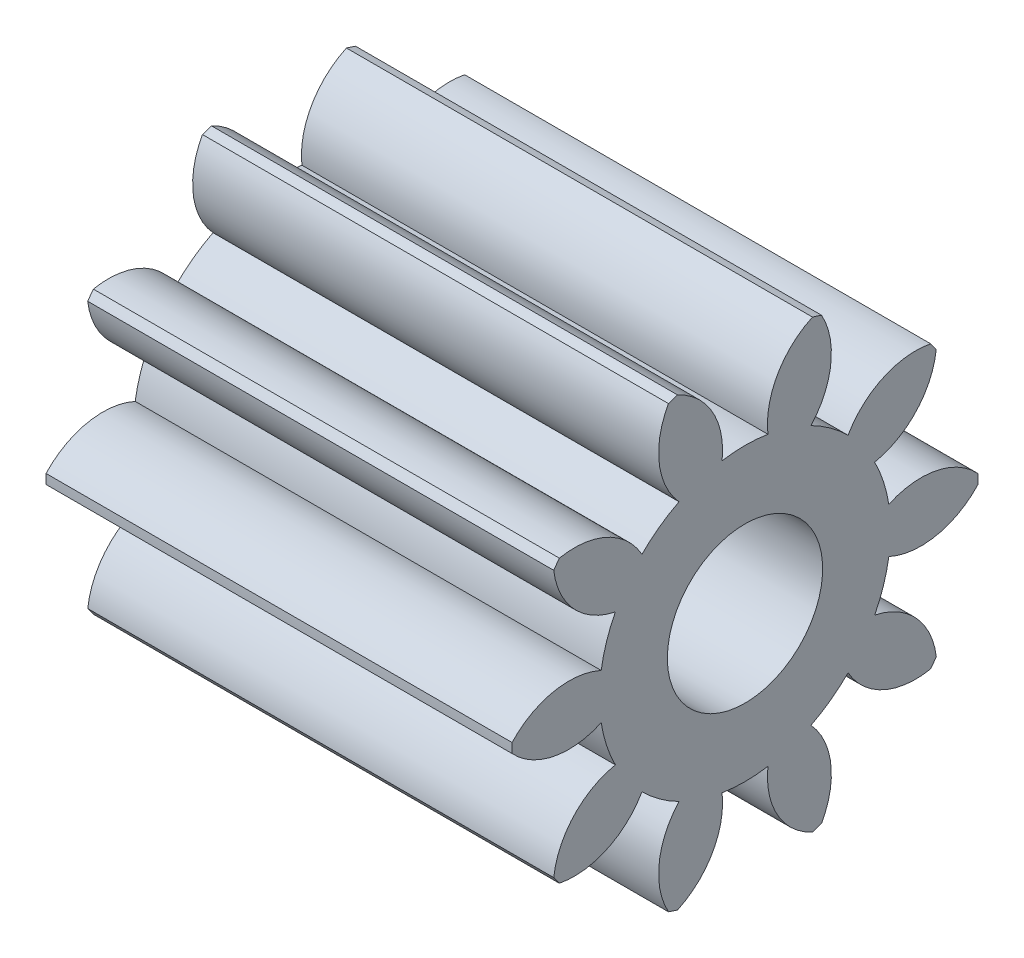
ISO-10303-21;
HEADER;
FILE_DESCRIPTION(('STEP AP214'),'2;1');
FILE_NAME('part.step','',(''),(''),'','','');
FILE_SCHEMA(('AUTOMOTIVE_DESIGN { 1 0 10303 214 1 1 1 1 }'));
ENDSEC;
DATA;
#1=APPLICATION_CONTEXT('core data for automotive mechanical design processes');
#2=APPLICATION_PROTOCOL_DEFINITION('international standard','automotive_design',2000,#1);
#3=PRODUCT_CONTEXT('',#1,'mechanical');
#4=PRODUCT('Part','Part','',(#3));
#5=PRODUCT_RELATED_PRODUCT_CATEGORY('part','',(#4));
#6=PRODUCT_DEFINITION_FORMATION('','',#4);
#7=PRODUCT_DEFINITION_CONTEXT('part definition',#1,'design');
#8=PRODUCT_DEFINITION('design','',#6,#7);
#9=PRODUCT_DEFINITION_SHAPE('','',#8);
#10=(LENGTH_UNIT() NAMED_UNIT(*) SI_UNIT(.MILLI.,.METRE.));
#11=(NAMED_UNIT(*) PLANE_ANGLE_UNIT() SI_UNIT($,.RADIAN.));
#12=(NAMED_UNIT(*) SI_UNIT($,.STERADIAN.) SOLID_ANGLE_UNIT());
#13=UNCERTAINTY_MEASURE_WITH_UNIT(LENGTH_MEASURE(1.E-05),#10,'distance_accuracy_value','');
#14=(GEOMETRIC_REPRESENTATION_CONTEXT(3) GLOBAL_UNCERTAINTY_ASSIGNED_CONTEXT((#13)) GLOBAL_UNIT_ASSIGNED_CONTEXT((#10,
#11,#12)) REPRESENTATION_CONTEXT('',''));
#15=CARTESIAN_POINT('',(0.,0.,0.));
#16=DIRECTION('',(0.,0.,1.));
#17=DIRECTION('',(1.,0.,0.));
#18=AXIS2_PLACEMENT_3D('',#15,#16,#17);
#19=CARTESIAN_POINT('',(15.,0.,0.));
#20=DIRECTION('',(-1.,0.,0.));
#21=DIRECTION('',(0.,0.,1.));
#22=AXIS2_PLACEMENT_3D('',#19,#20,#21);
#23=PLANE('',#22);
#24=CARTESIAN_POINT('',(15.,0.,0.));
#25=DIRECTION('',(-1.,0.,0.));
#26=DIRECTION('',(0.,0.,1.));
#27=AXIS2_PLACEMENT_3D('',#24,#25,#26);
#28=CIRCLE('',#27,2.5);
#29=CARTESIAN_POINT('',(15.,0.,2.5));
#30=VERTEX_POINT('',#29);
#31=EDGE_CURVE('E382',#30,#30,#28,.F.);
#32=ORIENTED_EDGE('',*,*,#31,.F.);
#33=EDGE_LOOP('',(#32));
#34=FACE_BOUND('',#33,.T.);
#35=CARTESIAN_POINT('',(15.,-1.54652480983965,-5.66580237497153));
#36=DIRECTION('',(-1.,0.,0.));
#37=DIRECTION('',(0.,-0.95105651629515,-0.309016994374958));
#38=AXIS2_PLACEMENT_3D('',#35,#36,#37);
#39=CIRCLE('',#38,2.5);
#40=CARTESIAN_POINT('',(15.,0.728583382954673,-4.62951925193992));
#41=VERTEX_POINT('',#40);
#42=CARTESIAN_POINT('',(15.,0.153919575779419,-7.49842041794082));
#43=VERTEX_POINT('',#42);
#44=EDGE_CURVE('E391',#41,#43,#39,.T.);
#45=ORIENTED_EDGE('',*,*,#44,.F.);
#46=CARTESIAN_POINT('',(15.,0.,0.));
#47=DIRECTION('',(-1.,0.,0.));
#48=DIRECTION('',(0.,-0.95105651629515,-0.309016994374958));
#49=AXIS2_PLACEMENT_3D('',#46,#47,#48);
#50=CIRCLE('',#49,4.6865);
#51=CARTESIAN_POINT('',(15.,2.13172680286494,-4.17361031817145));
#52=VERTEX_POINT('',#51);
#53=EDGE_CURVE('E398',#52,#41,#50,.T.);
#54=ORIENTED_EDGE('',*,*,#53,.F.);
#55=CARTESIAN_POINT('',(15.,4.58143993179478,-3.67470593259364));
#56=DIRECTION('',(-1.,0.,0.));
#57=DIRECTION('',(0.,-0.95105651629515,-0.309016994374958));
#58=AXIS2_PLACEMENT_3D('',#55,#56,#57);
#59=CIRCLE('',#58,2.5);
#60=CARTESIAN_POINT('',(15.,4.28293738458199,-6.15682120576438));
#61=VERTEX_POINT('',#60);
#62=EDGE_CURVE('E394',#61,#52,#59,.T.);
#63=ORIENTED_EDGE('',*,*,#62,.F.);
#64=CARTESIAN_POINT('',(15.,0.,0.));
#65=DIRECTION('',(-1.,0.,0.));
#66=DIRECTION('',(0.,0.,1.));
#67=AXIS2_PLACEMENT_3D('',#64,#65,#66);
#68=CIRCLE('',#67,7.5);
#69=CARTESIAN_POINT('',(15.,4.53198448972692,-5.97587789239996));
#70=VERTEX_POINT('',#69);
#71=EDGE_CURVE('E628',#70,#61,#68,.T.);
#72=ORIENTED_EDGE('',*,*,#71,.F.);
#73=CARTESIAN_POINT('',(15.,2.07911022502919,-5.49275488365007));
#74=DIRECTION('',(-1.,0.,0.));
#75=DIRECTION('',(0.,-0.587785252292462,-0.809016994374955));
#76=AXIS2_PLACEMENT_3D('',#73,#74,#75);
#77=CIRCLE('',#76,2.5);
#78=CARTESIAN_POINT('',(15.,3.31059948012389,-3.31710918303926));
#79=VERTEX_POINT('',#78);
#80=EDGE_CURVE('E369',#79,#70,#77,.T.);
#81=ORIENTED_EDGE('',*,*,#80,.F.);
#82=CARTESIAN_POINT('',(15.,0.,0.));
#83=DIRECTION('',(-1.,0.,0.));
#84=DIRECTION('',(0.,-0.587785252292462,-0.809016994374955));
#85=AXIS2_PLACEMENT_3D('',#82,#83,#84);
#86=CIRCLE('',#85,4.6865);
#87=CARTESIAN_POINT('',(15.,4.17778980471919,-2.12352409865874));
#88=VERTEX_POINT('',#87);
#89=EDGE_CURVE('E376',#88,#79,#86,.T.);
#90=ORIENTED_EDGE('',*,*,#89,.F.);
#91=CARTESIAN_POINT('',(15.,5.86640071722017,-0.279996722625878));
#92=DIRECTION('',(-1.,0.,0.));
#93=DIRECTION('',(0.,-0.587785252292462,-0.809016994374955));
#94=AXIS2_PLACEMENT_3D('',#91,#92,#93);
#95=CIRCLE('',#94,2.5);
#96=CARTESIAN_POINT('',(15.,7.08385783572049,-2.46352555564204));
#97=VERTEX_POINT('',#96);
#98=EDGE_CURVE('E372',#97,#88,#95,.T.);
#99=ORIENTED_EDGE('',*,*,#98,.F.);
#100=CARTESIAN_POINT('',(15.,7.17898536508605,-2.17075312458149));
#101=VERTEX_POINT('',#100);
#102=EDGE_CURVE('E623',#101,#97,#68,.T.);
#103=ORIENTED_EDGE('',*,*,#102,.F.);
#104=CARTESIAN_POINT('',(15.,4.91059582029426,-3.22166171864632));
#105=DIRECTION('',(-1.,0.,0.));
#106=DIRECTION('',(0.,0.,-1.));
#107=AXIS2_PLACEMENT_3D('',#104,#105,#106);
#108=CIRCLE('',#107,2.5);
#109=CARTESIAN_POINT('',(15.,4.6280790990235,-0.737676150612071));
#110=VERTEX_POINT('',#109);
#111=EDGE_CURVE('E585',#110,#101,#108,.T.);
#112=ORIENTED_EDGE('',*,*,#111,.F.);
#113=CARTESIAN_POINT('',(15.,0.,0.));
#114=DIRECTION('',(-1.,0.,0.));
#115=DIRECTION('',(0.,0.,-1.));
#116=AXIS2_PLACEMENT_3D('',#113,#114,#115);
#117=CIRCLE('',#116,4.6865);
#118=CARTESIAN_POINT('',(15.,4.6280790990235,0.73767615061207));
#119=VERTEX_POINT('',#118);
#120=EDGE_CURVE('E592',#119,#110,#117,.T.);
#121=ORIENTED_EDGE('',*,*,#120,.F.);
#122=CARTESIAN_POINT('',(15.,4.91059582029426,3.22166171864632));
#123=DIRECTION('',(-1.,0.,0.));
#124=DIRECTION('',(0.,0.,-1.));
#125=AXIS2_PLACEMENT_3D('',#122,#123,#124);
#126=CIRCLE('',#125,2.5);
#127=CARTESIAN_POINT('',(15.,7.17898536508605,2.17075312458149));
#128=VERTEX_POINT('',#127);
#129=EDGE_CURVE('E588',#128,#119,#126,.T.);
#130=ORIENTED_EDGE('',*,*,#129,.F.);
#131=CARTESIAN_POINT('',(15.,7.08385783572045,2.46352555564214));
#132=VERTEX_POINT('',#131);
#133=EDGE_CURVE('E620',#132,#128,#68,.T.);
#134=ORIENTED_EDGE('',*,*,#133,.F.);
#135=CARTESIAN_POINT('',(15.,5.86640071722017,0.279996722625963));
#136=DIRECTION('',(-1.,0.,0.));
#137=DIRECTION('',(0.,0.587785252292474,-0.809016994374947));
#138=AXIS2_PLACEMENT_3D('',#135,#136,#137);
#139=CIRCLE('',#138,2.5);
#140=CARTESIAN_POINT('',(15.,4.17778980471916,2.1235240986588));
#141=VERTEX_POINT('',#140);
#142=EDGE_CURVE('E554',#141,#132,#139,.T.);
#143=ORIENTED_EDGE('',*,*,#142,.F.);
#144=CARTESIAN_POINT('',(15.,0.,0.));
#145=DIRECTION('',(-1.,0.,0.));
#146=DIRECTION('',(0.,0.587785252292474,-0.809016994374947));
#147=AXIS2_PLACEMENT_3D('',#144,#145,#146);
#148=CIRCLE('',#147,4.6865);
#149=CARTESIAN_POINT('',(15.,3.31059948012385,3.31710918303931));
#150=VERTEX_POINT('',#149);
#151=EDGE_CURVE('E561',#150,#141,#148,.T.);
#152=ORIENTED_EDGE('',*,*,#151,.F.);
#153=CARTESIAN_POINT('',(15.,2.07911022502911,5.4927548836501));
#154=DIRECTION('',(-1.,0.,0.));
#155=DIRECTION('',(0.,0.587785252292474,-0.809016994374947));
#156=AXIS2_PLACEMENT_3D('',#153,#154,#155);
#157=CIRCLE('',#156,2.5);
#158=CARTESIAN_POINT('',(15.,4.53198448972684,5.97587789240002));
#159=VERTEX_POINT('',#158);
#160=EDGE_CURVE('E557',#159,#150,#157,.T.);
#161=ORIENTED_EDGE('',*,*,#160,.F.);
#162=CARTESIAN_POINT('',(15.,4.2829373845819,6.15682120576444));
#163=VERTEX_POINT('',#162);
#164=EDGE_CURVE('E629',#163,#159,#68,.T.);
#165=ORIENTED_EDGE('',*,*,#164,.F.);
#166=CARTESIAN_POINT('',(15.,4.58143993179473,3.6747059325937));
#167=DIRECTION('',(-1.,0.,0.));
#168=DIRECTION('',(0.,0.951056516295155,-0.309016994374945));
#169=AXIS2_PLACEMENT_3D('',#166,#167,#168);
#170=CIRCLE('',#169,2.5);
#171=CARTESIAN_POINT('',(15.,2.13172680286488,4.17361031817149));
#172=VERTEX_POINT('',#171);
#173=EDGE_CURVE('E459',#172,#163,#170,.T.);
#174=ORIENTED_EDGE('',*,*,#173,.F.);
#175=CARTESIAN_POINT('',(15.,0.,0.));
#176=DIRECTION('',(-1.,0.,0.));
#177=DIRECTION('',(0.,0.951056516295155,-0.309016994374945));
#178=AXIS2_PLACEMENT_3D('',#175,#176,#177);
#179=CIRCLE('',#178,4.6865);
#180=CARTESIAN_POINT('',(15.,0.728583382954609,4.62951925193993));
#181=VERTEX_POINT('',#180);
#182=EDGE_CURVE('E466',#181,#172,#179,.T.);
#183=ORIENTED_EDGE('',*,*,#182,.F.);
#184=CARTESIAN_POINT('',(15.,-1.54652480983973,5.66580237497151));
#185=DIRECTION('',(-1.,0.,0.));
#186=DIRECTION('',(0.,0.951056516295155,-0.309016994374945));
#187=AXIS2_PLACEMENT_3D('',#184,#185,#186);
#188=CIRCLE('',#187,2.5);
#189=CARTESIAN_POINT('',(15.,0.153919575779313,7.49842041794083));
#190=VERTEX_POINT('',#189);
#191=EDGE_CURVE('E462',#190,#181,#188,.T.);
#192=ORIENTED_EDGE('',*,*,#191,.F.);
#193=CARTESIAN_POINT('',(15.,-0.153919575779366,7.49842041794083));
#194=VERTEX_POINT('',#193);
#195=EDGE_CURVE('E810',#194,#190,#68,.T.);
#196=ORIENTED_EDGE('',*,*,#195,.F.);
#197=CARTESIAN_POINT('',(15.,1.54652480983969,5.66580237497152));
#198=DIRECTION('',(-1.,0.,0.));
#199=DIRECTION('',(0.,0.951056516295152,0.309016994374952));
#200=AXIS2_PLACEMENT_3D('',#197,#198,#199);
#201=CIRCLE('',#200,2.5);
#202=CARTESIAN_POINT('',(15.,-0.728583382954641,4.62951925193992));
#203=VERTEX_POINT('',#202);
#204=EDGE_CURVE('E485',#203,#194,#201,.T.);
#205=ORIENTED_EDGE('',*,*,#204,.F.);
#206=CARTESIAN_POINT('',(15.,0.,0.));
#207=DIRECTION('',(-1.,0.,0.));
#208=DIRECTION('',(0.,0.951056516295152,0.309016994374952));
#209=AXIS2_PLACEMENT_3D('',#206,#207,#208);
#210=CIRCLE('',#209,4.6865);
#211=CARTESIAN_POINT('',(15.,-2.13172680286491,4.17361031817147));
#212=VERTEX_POINT('',#211);
#213=EDGE_CURVE('E492',#212,#203,#210,.T.);
#214=ORIENTED_EDGE('',*,*,#213,.F.);
#215=CARTESIAN_POINT('',(15.,-4.58143993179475,3.67470593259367));
#216=DIRECTION('',(-1.,0.,0.));
#217=DIRECTION('',(0.,0.951056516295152,0.309016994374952));
#218=AXIS2_PLACEMENT_3D('',#215,#216,#217);
#219=CIRCLE('',#218,2.5);
#220=CARTESIAN_POINT('',(15.,-4.28293738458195,6.15682120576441));
#221=VERTEX_POINT('',#220);
#222=EDGE_CURVE('E488',#221,#212,#219,.T.);
#223=ORIENTED_EDGE('',*,*,#222,.F.);
#224=CARTESIAN_POINT('',(15.,-4.53198448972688,5.97587789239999));
#225=VERTEX_POINT('',#224);
#226=EDGE_CURVE('E791',#225,#221,#68,.T.);
#227=ORIENTED_EDGE('',*,*,#226,.F.);
#228=CARTESIAN_POINT('',(15.,-2.07911022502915,5.49275488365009));
#229=DIRECTION('',(-1.,0.,0.));
#230=DIRECTION('',(0.,0.587785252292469,0.809016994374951));
#231=AXIS2_PLACEMENT_3D('',#228,#229,#230);
#232=CIRCLE('',#231,2.5);
#233=CARTESIAN_POINT('',(15.,-3.31059948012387,3.31710918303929));
#234=VERTEX_POINT('',#233);
#235=EDGE_CURVE('E435',#234,#225,#232,.T.);
#236=ORIENTED_EDGE('',*,*,#235,.F.);
#237=CARTESIAN_POINT('',(15.,0.,0.));
#238=DIRECTION('',(-1.,0.,0.));
#239=DIRECTION('',(0.,0.587785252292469,0.809016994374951));
#240=AXIS2_PLACEMENT_3D('',#237,#238,#239);
#241=CIRCLE('',#240,4.6865);
#242=CARTESIAN_POINT('',(15.,-4.17778980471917,2.12352409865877));
#243=VERTEX_POINT('',#242);
#244=EDGE_CURVE('E442',#243,#234,#241,.T.);
#245=ORIENTED_EDGE('',*,*,#244,.F.);
#246=CARTESIAN_POINT('',(15.,-5.86640071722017,0.279996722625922));
#247=DIRECTION('',(-1.,0.,0.));
#248=DIRECTION('',(0.,0.587785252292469,0.809016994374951));
#249=AXIS2_PLACEMENT_3D('',#246,#247,#248);
#250=CIRCLE('',#249,2.5);
#251=CARTESIAN_POINT('',(15.,-7.08385783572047,2.46352555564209));
#252=VERTEX_POINT('',#251);
#253=EDGE_CURVE('E438',#252,#243,#250,.T.);
#254=ORIENTED_EDGE('',*,*,#253,.F.);
#255=CARTESIAN_POINT('',(15.,-7.17898536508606,2.17075312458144));
#256=VERTEX_POINT('',#255);
#257=EDGE_CURVE('E772',#256,#252,#68,.T.);
#258=ORIENTED_EDGE('',*,*,#257,.F.);
#259=CARTESIAN_POINT('',(15.,-4.91059582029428,3.22166171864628));
#260=DIRECTION('',(-1.,0.,0.));
#261=DIRECTION('',(0.,0.,1.));
#262=AXIS2_PLACEMENT_3D('',#259,#260,#261);
#263=CIRCLE('',#262,2.5);
#264=CARTESIAN_POINT('',(15.,-4.6280790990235,0.737676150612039));
#265=VERTEX_POINT('',#264);
#266=EDGE_CURVE('E411',#265,#256,#263,.T.);
#267=ORIENTED_EDGE('',*,*,#266,.F.);
#268=CARTESIAN_POINT('',(15.,0.,0.));
#269=DIRECTION('',(-1.,0.,0.));
#270=DIRECTION('',(0.,0.,1.));
#271=AXIS2_PLACEMENT_3D('',#268,#269,#270);
#272=CIRCLE('',#271,4.6865);
#273=CARTESIAN_POINT('',(15.,-4.62807909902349,-0.737676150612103));
#274=VERTEX_POINT('',#273);
#275=EDGE_CURVE('E418',#274,#265,#272,.T.);
#276=ORIENTED_EDGE('',*,*,#275,.F.);
#277=CARTESIAN_POINT('',(15.,-4.91059582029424,-3.22166171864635));
#278=DIRECTION('',(-1.,0.,0.));
#279=DIRECTION('',(0.,0.,1.));
#280=AXIS2_PLACEMENT_3D('',#277,#278,#279);
#281=CIRCLE('',#280,2.5);
#282=CARTESIAN_POINT('',(15.,-7.17898536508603,-2.17075312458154));
#283=VERTEX_POINT('',#282);
#284=EDGE_CURVE('E414',#283,#274,#281,.T.);
#285=ORIENTED_EDGE('',*,*,#284,.F.);
#286=CARTESIAN_POINT('',(15.,-7.08385783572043,-2.46352555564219));
#287=VERTEX_POINT('',#286);
#288=EDGE_CURVE('E753',#287,#283,#68,.T.);
#289=ORIENTED_EDGE('',*,*,#288,.F.);
#290=CARTESIAN_POINT('',(15.,-5.86640071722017,-0.279996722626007));
#291=DIRECTION('',(-1.,0.,0.));
#292=DIRECTION('',(0.,-0.58778525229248,0.809016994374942));
#293=AXIS2_PLACEMENT_3D('',#290,#291,#292);
#294=CIRCLE('',#293,2.5);
#295=CARTESIAN_POINT('',(15.,-4.17778980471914,-2.12352409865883));
#296=VERTEX_POINT('',#295);
#297=EDGE_CURVE('E345',#296,#287,#294,.T.);
#298=ORIENTED_EDGE('',*,*,#297,.F.);
#299=CARTESIAN_POINT('',(15.,0.,0.));
#300=DIRECTION('',(-1.,0.,0.));
#301=DIRECTION('',(0.,-0.58778525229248,0.809016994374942));
#302=AXIS2_PLACEMENT_3D('',#299,#300,#301);
#303=CIRCLE('',#302,4.6865);
#304=CARTESIAN_POINT('',(15.,-3.31059948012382,-3.31710918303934));
#305=VERTEX_POINT('',#304);
#306=EDGE_CURVE('E352',#305,#296,#303,.T.);
#307=ORIENTED_EDGE('',*,*,#306,.F.);
#308=CARTESIAN_POINT('',(15.,-2.07911022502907,-5.49275488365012));
#309=DIRECTION('',(-1.,0.,0.));
#310=DIRECTION('',(0.,-0.58778525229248,0.809016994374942));
#311=AXIS2_PLACEMENT_3D('',#308,#309,#310);
#312=CIRCLE('',#311,2.5);
#313=CARTESIAN_POINT('',(15.,-4.53198448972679,-5.97587789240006));
#314=VERTEX_POINT('',#313);
#315=EDGE_CURVE('E348',#314,#305,#312,.T.);
#316=ORIENTED_EDGE('',*,*,#315,.F.);
#317=CARTESIAN_POINT('',(15.,-4.28293738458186,-6.15682120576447));
#318=VERTEX_POINT('',#317);
#319=EDGE_CURVE('E734',#318,#314,#68,.T.);
#320=ORIENTED_EDGE('',*,*,#319,.F.);
#321=CARTESIAN_POINT('',(15.,-4.5814399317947,-3.67470593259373));
#322=DIRECTION('',(-1.,0.,0.));
#323=DIRECTION('',(0.,-0.951056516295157,0.309016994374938));
#324=AXIS2_PLACEMENT_3D('',#321,#322,#323);
#325=CIRCLE('',#324,2.5);
#326=CARTESIAN_POINT('',(15.,-2.13172680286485,-4.1736103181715));
#327=VERTEX_POINT('',#326);
#328=EDGE_CURVE('E316',#327,#318,#325,.T.);
#329=ORIENTED_EDGE('',*,*,#328,.F.);
#330=CARTESIAN_POINT('',(15.,0.,0.));
#331=DIRECTION('',(-1.,0.,0.));
#332=DIRECTION('',(0.,-0.951056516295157,0.309016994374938));
#333=AXIS2_PLACEMENT_3D('',#330,#331,#332);
#334=CIRCLE('',#333,4.6865);
#335=CARTESIAN_POINT('',(15.,-0.728583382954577,-4.62951925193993));
#336=VERTEX_POINT('',#335);
#337=EDGE_CURVE('E315',#336,#327,#334,.T.);
#338=ORIENTED_EDGE('',*,*,#337,.F.);
#339=CARTESIAN_POINT('',(15.,1.54652480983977,-5.6658023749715));
#340=DIRECTION('',(-1.,0.,0.));
#341=DIRECTION('',(0.,-0.951056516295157,0.309016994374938));
#342=AXIS2_PLACEMENT_3D('',#339,#340,#341);
#343=CIRCLE('',#342,2.5);
#344=CARTESIAN_POINT('',(15.,-0.153919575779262,-7.49842041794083));
#345=VERTEX_POINT('',#344);
#346=EDGE_CURVE('E303',#345,#336,#343,.T.);
#347=ORIENTED_EDGE('',*,*,#346,.F.);
#348=EDGE_CURVE('E875',#43,#345,#68,.T.);
#349=ORIENTED_EDGE('',*,*,#348,.F.);
#350=EDGE_LOOP('',(#45,#54,#63,#72,#81,#90,#99,#103,#112,#121,#130,#134,#143,#152,#161,#165,
#174,#183,#192,#196,#205,#214,#223,#227,#236,#245,#254,#258,#267,#276,#285,#289,#298,#307,#316,
#320,#329,#338,#347,#349));
#351=FACE_BOUND('',#350,.T.);
#352=ADVANCED_FACE('F45',(#34,#351),#23,.F.);
#353=CARTESIAN_POINT('',(-10.,0.,0.));
#354=DIRECTION('',(-1.,0.,0.));
#355=DIRECTION('',(0.,0.,1.));
#356=AXIS2_PLACEMENT_3D('',#353,#354,#355);
#357=CYLINDRICAL_SURFACE('',#356,7.5);
#358=DIRECTION('',(-1.,0.,0.));
#359=VECTOR('',#358,1.);
#360=CARTESIAN_POINT('',(7.5,0.153919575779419,-7.49842041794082));
#361=LINE('',#360,#359);
#362=CARTESIAN_POINT('',(0.,0.153919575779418,-7.49842041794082));
#363=VERTEX_POINT('',#362);
#364=EDGE_CURVE('E550',#43,#363,#361,.T.);
#365=ORIENTED_EDGE('',*,*,#364,.F.);
#366=ORIENTED_EDGE('',*,*,#348,.T.);
#367=DIRECTION('',(-1.,0.,0.));
#368=VECTOR('',#367,1.);
#369=CARTESIAN_POINT('',(7.5,-0.153919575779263,-7.49842041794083));
#370=LINE('',#369,#368);
#371=CARTESIAN_POINT('',(0.,-0.153919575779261,-7.49842041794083));
#372=VERTEX_POINT('',#371);
#373=EDGE_CURVE('E309',#372,#345,#370,.F.);
#374=ORIENTED_EDGE('',*,*,#373,.F.);
#375=CARTESIAN_POINT('',(0.,0.,0.));
#376=DIRECTION('',(-1.,0.,0.));
#377=DIRECTION('',(0.,0.,1.));
#378=AXIS2_PLACEMENT_3D('',#375,#376,#377);
#379=CIRCLE('',#378,7.5);
#380=EDGE_CURVE('E696',#363,#372,#379,.T.);
#381=ORIENTED_EDGE('',*,*,#380,.F.);
#382=EDGE_LOOP('',(#365,#366,#374,#381));
#383=FACE_BOUND('',#382,.T.);
#384=ADVANCED_FACE('F855',(#383),#357,.T.);
#385=DIRECTION('',(-1.,0.,0.));
#386=VECTOR('',#385,1.);
#387=CARTESIAN_POINT('',(7.5,4.28293738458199,-6.15682120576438));
#388=LINE('',#387,#386);
#389=CARTESIAN_POINT('',(0.,4.28293738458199,-6.15682120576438));
#390=VERTEX_POINT('',#389);
#391=EDGE_CURVE('E547',#390,#61,#388,.F.);
#392=ORIENTED_EDGE('',*,*,#391,.F.);
#393=CARTESIAN_POINT('',(0.,4.53198448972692,-5.97587789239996));
#394=VERTEX_POINT('',#393);
#395=EDGE_CURVE('E621',#394,#390,#379,.T.);
#396=ORIENTED_EDGE('',*,*,#395,.F.);
#397=DIRECTION('',(-1.,0.,0.));
#398=VECTOR('',#397,1.);
#399=CARTESIAN_POINT('',(7.5,4.53198448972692,-5.97587789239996));
#400=LINE('',#399,#398);
#401=EDGE_CURVE('E544',#70,#394,#400,.T.);
#402=ORIENTED_EDGE('',*,*,#401,.F.);
#403=ORIENTED_EDGE('',*,*,#71,.T.);
#404=EDGE_LOOP('',(#392,#396,#402,#403));
#405=FACE_BOUND('',#404,.T.);
#406=ADVANCED_FACE('F692',(#405),#357,.T.);
#407=DIRECTION('',(-1.,0.,0.));
#408=VECTOR('',#407,1.);
#409=CARTESIAN_POINT('',(7.5,7.08385783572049,-2.46352555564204));
#410=LINE('',#409,#408);
#411=CARTESIAN_POINT('',(0.,7.08385783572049,-2.46352555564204));
#412=VERTEX_POINT('',#411);
#413=EDGE_CURVE('E541',#412,#97,#410,.F.);
#414=ORIENTED_EDGE('',*,*,#413,.F.);
#415=CARTESIAN_POINT('',(0.,7.17898536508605,-2.17075312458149));
#416=VERTEX_POINT('',#415);
#417=EDGE_CURVE('E616',#416,#412,#379,.T.);
#418=ORIENTED_EDGE('',*,*,#417,.F.);
#419=DIRECTION('',(-1.,0.,0.));
#420=VECTOR('',#419,1.);
#421=CARTESIAN_POINT('',(7.5,7.17898536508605,-2.17075312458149));
#422=LINE('',#421,#420);
#423=EDGE_CURVE('E612',#101,#416,#422,.T.);
#424=ORIENTED_EDGE('',*,*,#423,.F.);
#425=ORIENTED_EDGE('',*,*,#102,.T.);
#426=EDGE_LOOP('',(#414,#418,#424,#425));
#427=FACE_BOUND('',#426,.T.);
#428=ADVANCED_FACE('F666',(#427),#357,.T.);
#429=DIRECTION('',(-1.,0.,0.));
#430=VECTOR('',#429,1.);
#431=CARTESIAN_POINT('',(7.5,-7.08385783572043,-2.46352555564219));
#432=LINE('',#431,#430);
#433=CARTESIAN_POINT('',(0.,-7.08385783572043,-2.46352555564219));
#434=VERTEX_POINT('',#433);
#435=EDGE_CURVE('E538',#287,#434,#432,.T.);
#436=ORIENTED_EDGE('',*,*,#435,.F.);
#437=ORIENTED_EDGE('',*,*,#288,.T.);
#438=DIRECTION('',(-1.,0.,0.));
#439=VECTOR('',#438,1.);
#440=CARTESIAN_POINT('',(7.5,-7.17898536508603,-2.17075312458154));
#441=LINE('',#440,#439);
#442=CARTESIAN_POINT('',(0.,-7.17898536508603,-2.17075312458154));
#443=VERTEX_POINT('',#442);
#444=EDGE_CURVE('E512',#443,#283,#441,.F.);
#445=ORIENTED_EDGE('',*,*,#444,.F.);
#446=EDGE_CURVE('E718',#434,#443,#379,.T.);
#447=ORIENTED_EDGE('',*,*,#446,.F.);
#448=EDGE_LOOP('',(#436,#437,#445,#447));
#449=FACE_BOUND('',#448,.T.);
#450=ADVANCED_FACE('F751',(#449),#357,.T.);
#451=DIRECTION('',(-1.,0.,0.));
#452=VECTOR('',#451,1.);
#453=CARTESIAN_POINT('',(7.5,-4.53198448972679,-5.97587789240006));
#454=LINE('',#453,#452);
#455=CARTESIAN_POINT('',(0.,-4.53198448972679,-5.97587789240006));
#456=VERTEX_POINT('',#455);
#457=EDGE_CURVE('E535',#456,#314,#454,.F.);
#458=ORIENTED_EDGE('',*,*,#457,.F.);
#459=CARTESIAN_POINT('',(0.,-4.28293738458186,-6.15682120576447));
#460=VERTEX_POINT('',#459);
#461=EDGE_CURVE('E699',#460,#456,#379,.T.);
#462=ORIENTED_EDGE('',*,*,#461,.F.);
#463=DIRECTION('',(-1.,0.,0.));
#464=VECTOR('',#463,1.);
#465=CARTESIAN_POINT('',(7.5,-4.28293738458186,-6.15682120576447));
#466=LINE('',#465,#464);
#467=EDGE_CURVE('E532',#318,#460,#466,.T.);
#468=ORIENTED_EDGE('',*,*,#467,.F.);
#469=ORIENTED_EDGE('',*,*,#319,.T.);
#470=EDGE_LOOP('',(#458,#462,#468,#469));
#471=FACE_BOUND('',#470,.T.);
#472=ADVANCED_FACE('F732',(#471),#357,.T.);
#473=DIRECTION('',(-1.,0.,0.));
#474=VECTOR('',#473,1.);
#475=CARTESIAN_POINT('',(7.5,4.2829373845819,6.15682120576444));
#476=LINE('',#475,#474);
#477=CARTESIAN_POINT('',(0.,4.2829373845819,6.15682120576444));
#478=VERTEX_POINT('',#477);
#479=EDGE_CURVE('E527',#163,#478,#476,.T.);
#480=ORIENTED_EDGE('',*,*,#479,.F.);
#481=ORIENTED_EDGE('',*,*,#164,.T.);
#482=DIRECTION('',(-1.,0.,0.));
#483=VECTOR('',#482,1.);
#484=CARTESIAN_POINT('',(7.5,4.53198448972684,5.97587789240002));
#485=LINE('',#484,#483);
#486=CARTESIAN_POINT('',(0.,4.53198448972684,5.97587789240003));
#487=VERTEX_POINT('',#486);
#488=EDGE_CURVE('E577',#487,#159,#485,.F.);
#489=ORIENTED_EDGE('',*,*,#488,.F.);
#490=EDGE_CURVE('E622',#478,#487,#379,.T.);
#491=ORIENTED_EDGE('',*,*,#490,.F.);
#492=EDGE_LOOP('',(#480,#481,#489,#491));
#493=FACE_BOUND('',#492,.T.);
#494=ADVANCED_FACE('F827',(#493),#357,.T.);
#495=DIRECTION('',(-1.,0.,0.));
#496=VECTOR('',#495,1.);
#497=CARTESIAN_POINT('',(7.5,0.153919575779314,7.49842041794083));
#498=LINE('',#497,#496);
#499=CARTESIAN_POINT('',(0.,0.153919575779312,7.49842041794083));
#500=VERTEX_POINT('',#499);
#501=EDGE_CURVE('E524',#500,#190,#498,.F.);
#502=ORIENTED_EDGE('',*,*,#501,.F.);
#503=CARTESIAN_POINT('',(0.,-0.153919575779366,7.49842041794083));
#504=VERTEX_POINT('',#503);
#505=EDGE_CURVE('E703',#504,#500,#379,.T.);
#506=ORIENTED_EDGE('',*,*,#505,.F.);
#507=DIRECTION('',(-1.,0.,0.));
#508=VECTOR('',#507,1.);
#509=CARTESIAN_POINT('',(7.5,-0.153919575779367,7.49842041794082));
#510=LINE('',#509,#508);
#511=EDGE_CURVE('E521',#194,#504,#510,.T.);
#512=ORIENTED_EDGE('',*,*,#511,.F.);
#513=ORIENTED_EDGE('',*,*,#195,.T.);
#514=EDGE_LOOP('',(#502,#506,#512,#513));
#515=FACE_BOUND('',#514,.T.);
#516=ADVANCED_FACE('F808',(#515),#357,.T.);
#517=DIRECTION('',(-1.,0.,0.));
#518=VECTOR('',#517,1.);
#519=CARTESIAN_POINT('',(7.5,-4.28293738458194,6.15682120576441));
#520=LINE('',#519,#518);
#521=CARTESIAN_POINT('',(0.,-4.28293738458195,6.15682120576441));
#522=VERTEX_POINT('',#521);
#523=EDGE_CURVE('E518',#522,#221,#520,.F.);
#524=ORIENTED_EDGE('',*,*,#523,.F.);
#525=CARTESIAN_POINT('',(0.,-4.53198448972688,5.97587789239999));
#526=VERTEX_POINT('',#525);
#527=EDGE_CURVE('E708',#526,#522,#379,.T.);
#528=ORIENTED_EDGE('',*,*,#527,.F.);
#529=DIRECTION('',(-1.,0.,0.));
#530=VECTOR('',#529,1.);
#531=CARTESIAN_POINT('',(7.5,-4.53198448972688,5.97587789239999));
#532=LINE('',#531,#530);
#533=EDGE_CURVE('E509',#225,#526,#532,.T.);
#534=ORIENTED_EDGE('',*,*,#533,.F.);
#535=ORIENTED_EDGE('',*,*,#226,.T.);
#536=EDGE_LOOP('',(#524,#528,#534,#535));
#537=FACE_BOUND('',#536,.T.);
#538=ADVANCED_FACE('F789',(#537),#357,.T.);
#539=DIRECTION('',(-1.,0.,0.));
#540=VECTOR('',#539,1.);
#541=CARTESIAN_POINT('',(7.5,-7.17898536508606,2.17075312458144));
#542=LINE('',#541,#540);
#543=CARTESIAN_POINT('',(0.,-7.17898536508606,2.17075312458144));
#544=VERTEX_POINT('',#543);
#545=EDGE_CURVE('E515',#256,#544,#542,.T.);
#546=ORIENTED_EDGE('',*,*,#545,.F.);
#547=ORIENTED_EDGE('',*,*,#257,.T.);
#548=DIRECTION('',(-1.,0.,0.));
#549=VECTOR('',#548,1.);
#550=CARTESIAN_POINT('',(7.5,-7.08385783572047,2.46352555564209));
#551=LINE('',#550,#549);
#552=CARTESIAN_POINT('',(0.,-7.08385783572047,2.46352555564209));
#553=VERTEX_POINT('',#552);
#554=EDGE_CURVE('E484',#553,#252,#551,.F.);
#555=ORIENTED_EDGE('',*,*,#554,.F.);
#556=EDGE_CURVE('E713',#544,#553,#379,.T.);
#557=ORIENTED_EDGE('',*,*,#556,.F.);
#558=EDGE_LOOP('',(#546,#547,#555,#557));
#559=FACE_BOUND('',#558,.T.);
#560=ADVANCED_FACE('F770',(#559),#357,.T.);
#561=CARTESIAN_POINT('',(0.,0.,0.));
#562=DIRECTION('',(1.,0.,0.));
#563=DIRECTION('',(0.,0.,-1.));
#564=AXIS2_PLACEMENT_3D('',#561,#562,#563);
#565=PLANE('',#564);
#566=CARTESIAN_POINT('',(0.,0.,0.));
#567=DIRECTION('',(1.,0.,0.));
#568=DIRECTION('',(0.,0.,-1.));
#569=AXIS2_PLACEMENT_3D('',#566,#567,#568);
#570=CIRCLE('',#569,2.5);
#571=CARTESIAN_POINT('',(0.,0.,-2.5));
#572=VERTEX_POINT('',#571);
#573=EDGE_CURVE('E48',#572,#572,#570,.F.);
#574=ORIENTED_EDGE('',*,*,#573,.F.);
#575=EDGE_LOOP('',(#574));
#576=FACE_BOUND('',#575,.T.);
#577=CARTESIAN_POINT('',(0.,-1.54652480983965,-5.66580237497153));
#578=DIRECTION('',(-1.,0.,0.));
#579=DIRECTION('',(0.,-0.95105651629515,-0.309016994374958));
#580=AXIS2_PLACEMENT_3D('',#577,#578,#579);
#581=CIRCLE('',#580,2.5);
#582=CARTESIAN_POINT('',(0.,0.728583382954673,-4.62951925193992));
#583=VERTEX_POINT('',#582);
#584=EDGE_CURVE('E61',#583,#363,#581,.T.);
#585=ORIENTED_EDGE('',*,*,#584,.T.);
#586=ORIENTED_EDGE('',*,*,#380,.T.);
#587=CARTESIAN_POINT('',(0.,1.54652480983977,-5.6658023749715));
#588=DIRECTION('',(1.,0.,0.));
#589=DIRECTION('',(0.,0.,-1.));
#590=AXIS2_PLACEMENT_3D('',#587,#588,#589);
#591=CIRCLE('',#590,2.5);
#592=CARTESIAN_POINT('',(0.,-0.728583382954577,-4.62951925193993));
#593=VERTEX_POINT('',#592);
#594=EDGE_CURVE('E649',#593,#372,#591,.T.);
#595=ORIENTED_EDGE('',*,*,#594,.F.);
#596=CARTESIAN_POINT('',(0.,0.,0.));
#597=DIRECTION('',(-1.,0.,0.));
#598=DIRECTION('',(0.,-0.951056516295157,0.309016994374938));
#599=AXIS2_PLACEMENT_3D('',#596,#597,#598);
#600=CIRCLE('',#599,4.6865);
#601=CARTESIAN_POINT('',(0.,-2.13172680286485,-4.1736103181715));
#602=VERTEX_POINT('',#601);
#603=EDGE_CURVE('E323',#593,#602,#600,.T.);
#604=ORIENTED_EDGE('',*,*,#603,.T.);
#605=CARTESIAN_POINT('',(0.,-4.5814399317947,-3.67470593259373));
#606=DIRECTION('',(-1.,0.,0.));
#607=DIRECTION('',(0.,-0.951056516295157,0.309016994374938));
#608=AXIS2_PLACEMENT_3D('',#605,#606,#607);
#609=CIRCLE('',#608,2.5);
#610=EDGE_CURVE('E338',#602,#460,#609,.T.);
#611=ORIENTED_EDGE('',*,*,#610,.T.);
#612=ORIENTED_EDGE('',*,*,#461,.T.);
#613=CARTESIAN_POINT('',(0.,-2.07911022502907,-5.49275488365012));
#614=DIRECTION('',(1.,0.,0.));
#615=DIRECTION('',(0.,0.,-1.));
#616=AXIS2_PLACEMENT_3D('',#613,#614,#615);
#617=CIRCLE('',#616,2.5);
#618=CARTESIAN_POINT('',(0.,-3.31059948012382,-3.31710918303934));
#619=VERTEX_POINT('',#618);
#620=EDGE_CURVE('E652',#619,#456,#617,.T.);
#621=ORIENTED_EDGE('',*,*,#620,.F.);
#622=CARTESIAN_POINT('',(0.,0.,0.));
#623=DIRECTION('',(-1.,0.,0.));
#624=DIRECTION('',(0.,-0.58778525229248,0.809016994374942));
#625=AXIS2_PLACEMENT_3D('',#622,#623,#624);
#626=CIRCLE('',#625,4.6865);
#627=CARTESIAN_POINT('',(0.,-4.17778980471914,-2.12352409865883));
#628=VERTEX_POINT('',#627);
#629=EDGE_CURVE('E349',#619,#628,#626,.T.);
#630=ORIENTED_EDGE('',*,*,#629,.T.);
#631=CARTESIAN_POINT('',(0.,-5.86640071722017,-0.279996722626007));
#632=DIRECTION('',(-1.,0.,0.));
#633=DIRECTION('',(0.,-0.58778525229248,0.809016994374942));
#634=AXIS2_PLACEMENT_3D('',#631,#632,#633);
#635=CIRCLE('',#634,2.5);
#636=EDGE_CURVE('E326',#628,#434,#635,.T.);
#637=ORIENTED_EDGE('',*,*,#636,.T.);
#638=ORIENTED_EDGE('',*,*,#446,.T.);
#639=CARTESIAN_POINT('',(0.,-4.91059582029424,-3.22166171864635));
#640=DIRECTION('',(1.,0.,0.));
#641=DIRECTION('',(0.,0.,-1.));
#642=AXIS2_PLACEMENT_3D('',#639,#640,#641);
#643=CIRCLE('',#642,2.5);
#644=CARTESIAN_POINT('',(0.,-4.62807909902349,-0.737676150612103));
#645=VERTEX_POINT('',#644);
#646=EDGE_CURVE('E640',#645,#443,#643,.T.);
#647=ORIENTED_EDGE('',*,*,#646,.F.);
#648=CARTESIAN_POINT('',(0.,0.,0.));
#649=DIRECTION('',(-1.,0.,0.));
#650=DIRECTION('',(0.,0.,1.));
#651=AXIS2_PLACEMENT_3D('',#648,#649,#650);
#652=CIRCLE('',#651,4.6865);
#653=CARTESIAN_POINT('',(0.,-4.6280790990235,0.737676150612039));
#654=VERTEX_POINT('',#653);
#655=EDGE_CURVE('E415',#645,#654,#652,.T.);
#656=ORIENTED_EDGE('',*,*,#655,.T.);
#657=CARTESIAN_POINT('',(0.,-4.91059582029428,3.22166171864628));
#658=DIRECTION('',(-1.,0.,0.));
#659=DIRECTION('',(0.,0.,1.));
#660=AXIS2_PLACEMENT_3D('',#657,#658,#659);
#661=CIRCLE('',#660,2.5);
#662=EDGE_CURVE('E368',#654,#544,#661,.T.);
#663=ORIENTED_EDGE('',*,*,#662,.T.);
#664=ORIENTED_EDGE('',*,*,#556,.T.);
#665=CARTESIAN_POINT('',(0.,-5.86640071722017,0.279996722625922));
#666=DIRECTION('',(1.,0.,0.));
#667=DIRECTION('',(0.,0.,-1.));
#668=AXIS2_PLACEMENT_3D('',#665,#666,#667);
#669=CIRCLE('',#668,2.5);
#670=CARTESIAN_POINT('',(0.,-4.17778980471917,2.12352409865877));
#671=VERTEX_POINT('',#670);
#672=EDGE_CURVE('E637',#671,#553,#669,.T.);
#673=ORIENTED_EDGE('',*,*,#672,.F.);
#674=CARTESIAN_POINT('',(0.,0.,0.));
#675=DIRECTION('',(-1.,0.,0.));
#676=DIRECTION('',(0.,0.587785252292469,0.809016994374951));
#677=AXIS2_PLACEMENT_3D('',#674,#675,#676);
#678=CIRCLE('',#677,4.6865);
#679=CARTESIAN_POINT('',(0.,-3.31059948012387,3.31710918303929));
#680=VERTEX_POINT('',#679);
#681=EDGE_CURVE('E439',#671,#680,#678,.T.);
#682=ORIENTED_EDGE('',*,*,#681,.T.);
#683=CARTESIAN_POINT('',(0.,-2.07911022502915,5.49275488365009));
#684=DIRECTION('',(-1.,0.,0.));
#685=DIRECTION('',(0.,0.587785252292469,0.809016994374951));
#686=AXIS2_PLACEMENT_3D('',#683,#684,#685);
#687=CIRCLE('',#686,2.5);
#688=EDGE_CURVE('E434',#680,#526,#687,.T.);
#689=ORIENTED_EDGE('',*,*,#688,.T.);
#690=ORIENTED_EDGE('',*,*,#527,.T.);
#691=CARTESIAN_POINT('',(0.,-4.58143993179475,3.67470593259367));
#692=DIRECTION('',(1.,0.,0.));
#693=DIRECTION('',(0.,0.,-1.));
#694=AXIS2_PLACEMENT_3D('',#691,#692,#693);
#695=CIRCLE('',#694,2.5);
#696=CARTESIAN_POINT('',(0.,-2.13172680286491,4.17361031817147));
#697=VERTEX_POINT('',#696);
#698=EDGE_CURVE('E643',#697,#522,#695,.T.);
#699=ORIENTED_EDGE('',*,*,#698,.F.);
#700=CARTESIAN_POINT('',(0.,0.,0.));
#701=DIRECTION('',(-1.,0.,0.));
#702=DIRECTION('',(0.,0.951056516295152,0.309016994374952));
#703=AXIS2_PLACEMENT_3D('',#700,#701,#702);
#704=CIRCLE('',#703,4.6865);
#705=CARTESIAN_POINT('',(0.,-0.728583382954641,4.62951925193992));
#706=VERTEX_POINT('',#705);
#707=EDGE_CURVE('E489',#697,#706,#704,.T.);
#708=ORIENTED_EDGE('',*,*,#707,.T.);
#709=CARTESIAN_POINT('',(0.,1.54652480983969,5.66580237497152));
#710=DIRECTION('',(-1.,0.,0.));
#711=DIRECTION('',(0.,0.951056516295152,0.309016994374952));
#712=AXIS2_PLACEMENT_3D('',#709,#710,#711);
#713=CIRCLE('',#712,2.5);
#714=EDGE_CURVE('E458',#706,#504,#713,.T.);
#715=ORIENTED_EDGE('',*,*,#714,.T.);
#716=ORIENTED_EDGE('',*,*,#505,.T.);
#717=CARTESIAN_POINT('',(0.,-1.54652480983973,5.66580237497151));
#718=DIRECTION('',(1.,0.,0.));
#719=DIRECTION('',(0.,0.,-1.));
#720=AXIS2_PLACEMENT_3D('',#717,#718,#719);
#721=CIRCLE('',#720,2.5);
#722=CARTESIAN_POINT('',(0.,0.728583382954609,4.62951925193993));
#723=VERTEX_POINT('',#722);
#724=EDGE_CURVE('E646',#723,#500,#721,.T.);
#725=ORIENTED_EDGE('',*,*,#724,.F.);
#726=CARTESIAN_POINT('',(0.,0.,0.));
#727=DIRECTION('',(-1.,0.,0.));
#728=DIRECTION('',(0.,0.951056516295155,-0.309016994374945));
#729=AXIS2_PLACEMENT_3D('',#726,#727,#728);
#730=CIRCLE('',#729,4.6865);
#731=CARTESIAN_POINT('',(0.,2.13172680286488,4.17361031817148));
#732=VERTEX_POINT('',#731);
#733=EDGE_CURVE('E463',#723,#732,#730,.T.);
#734=ORIENTED_EDGE('',*,*,#733,.T.);
#735=CARTESIAN_POINT('',(0.,4.58143993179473,3.6747059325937));
#736=DIRECTION('',(-1.,0.,0.));
#737=DIRECTION('',(0.,0.951056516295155,-0.309016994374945));
#738=AXIS2_PLACEMENT_3D('',#735,#736,#737);
#739=CIRCLE('',#738,2.5);
#740=EDGE_CURVE('E470',#732,#478,#739,.T.);
#741=ORIENTED_EDGE('',*,*,#740,.T.);
#742=ORIENTED_EDGE('',*,*,#490,.T.);
#743=CARTESIAN_POINT('',(0.,2.07911022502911,5.4927548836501));
#744=DIRECTION('',(1.,0.,0.));
#745=DIRECTION('',(0.,0.,-1.));
#746=AXIS2_PLACEMENT_3D('',#743,#744,#745);
#747=CIRCLE('',#746,2.5);
#748=CARTESIAN_POINT('',(0.,3.31059948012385,3.31710918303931));
#749=VERTEX_POINT('',#748);
#750=EDGE_CURVE('E633',#749,#487,#747,.T.);
#751=ORIENTED_EDGE('',*,*,#750,.F.);
#752=CARTESIAN_POINT('',(0.,0.,0.));
#753=DIRECTION('',(-1.,0.,0.));
#754=DIRECTION('',(0.,0.587785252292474,-0.809016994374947));
#755=AXIS2_PLACEMENT_3D('',#752,#753,#754);
#756=CIRCLE('',#755,4.6865);
#757=CARTESIAN_POINT('',(0.,4.17778980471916,2.1235240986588));
#758=VERTEX_POINT('',#757);
#759=EDGE_CURVE('E558',#749,#758,#756,.T.);
#760=ORIENTED_EDGE('',*,*,#759,.T.);
#761=CARTESIAN_POINT('',(0.,5.86640071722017,0.279996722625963));
#762=DIRECTION('',(-1.,0.,0.));
#763=DIRECTION('',(0.,0.587785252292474,-0.809016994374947));
#764=AXIS2_PLACEMENT_3D('',#761,#762,#763);
#765=CIRCLE('',#764,2.5);
#766=CARTESIAN_POINT('',(0.,7.08385783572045,2.46352555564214));
#767=VERTEX_POINT('',#766);
#768=EDGE_CURVE('E553',#758,#767,#765,.T.);
#769=ORIENTED_EDGE('',*,*,#768,.T.);
#770=CARTESIAN_POINT('',(0.,7.17898536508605,2.17075312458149));
#771=VERTEX_POINT('',#770);
#772=EDGE_CURVE('E615',#767,#771,#379,.T.);
#773=ORIENTED_EDGE('',*,*,#772,.T.);
#774=CARTESIAN_POINT('',(0.,4.91059582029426,3.22166171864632));
#775=DIRECTION('',(1.,0.,0.));
#776=DIRECTION('',(0.,0.,-1.));
#777=AXIS2_PLACEMENT_3D('',#774,#775,#776);
#778=CIRCLE('',#777,2.5);
#779=CARTESIAN_POINT('',(0.,4.6280790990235,0.73767615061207));
#780=VERTEX_POINT('',#779);
#781=EDGE_CURVE('E627',#780,#771,#778,.T.);
#782=ORIENTED_EDGE('',*,*,#781,.F.);
#783=CARTESIAN_POINT('',(0.,0.,0.));
#784=DIRECTION('',(-1.,0.,0.));
#785=DIRECTION('',(0.,0.,-1.));
#786=AXIS2_PLACEMENT_3D('',#783,#784,#785);
#787=CIRCLE('',#786,4.6865);
#788=CARTESIAN_POINT('',(0.,4.6280790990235,-0.737676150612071));
#789=VERTEX_POINT('',#788);
#790=EDGE_CURVE('E589',#780,#789,#787,.T.);
#791=ORIENTED_EDGE('',*,*,#790,.T.);
#792=CARTESIAN_POINT('',(0.,4.91059582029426,-3.22166171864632));
#793=DIRECTION('',(-1.,0.,0.));
#794=DIRECTION('',(0.,0.,-1.));
#795=AXIS2_PLACEMENT_3D('',#792,#793,#794);
#796=CIRCLE('',#795,2.5);
#797=EDGE_CURVE('E584',#789,#416,#796,.T.);
#798=ORIENTED_EDGE('',*,*,#797,.T.);
#799=ORIENTED_EDGE('',*,*,#417,.T.);
#800=CARTESIAN_POINT('',(0.,5.86640071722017,-0.279996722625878));
#801=DIRECTION('',(1.,0.,0.));
#802=DIRECTION('',(0.,0.,-1.));
#803=AXIS2_PLACEMENT_3D('',#800,#801,#802);
#804=CIRCLE('',#803,2.5);
#805=CARTESIAN_POINT('',(0.,4.17778980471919,-2.12352409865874));
#806=VERTEX_POINT('',#805);
#807=EDGE_CURVE('E54',#806,#412,#804,.T.);
#808=ORIENTED_EDGE('',*,*,#807,.F.);
#809=CARTESIAN_POINT('',(0.,0.,0.));
#810=DIRECTION('',(-1.,0.,0.));
#811=DIRECTION('',(0.,-0.587785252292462,-0.809016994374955));
#812=AXIS2_PLACEMENT_3D('',#809,#810,#811);
#813=CIRCLE('',#812,4.6865);
#814=CARTESIAN_POINT('',(0.,3.31059948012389,-3.31710918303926));
#815=VERTEX_POINT('',#814);
#816=EDGE_CURVE('E373',#806,#815,#813,.T.);
#817=ORIENTED_EDGE('',*,*,#816,.T.);
#818=CARTESIAN_POINT('',(0.,2.07911022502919,-5.49275488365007));
#819=DIRECTION('',(-1.,0.,0.));
#820=DIRECTION('',(0.,-0.587785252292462,-0.809016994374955));
#821=AXIS2_PLACEMENT_3D('',#818,#819,#820);
#822=CIRCLE('',#821,2.5);
#823=EDGE_CURVE('E69',#815,#394,#822,.T.);
#824=ORIENTED_EDGE('',*,*,#823,.T.);
#825=ORIENTED_EDGE('',*,*,#395,.T.);
#826=CARTESIAN_POINT('',(0.,4.58143993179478,-3.67470593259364));
#827=DIRECTION('',(1.,0.,0.));
#828=DIRECTION('',(0.,0.,-1.));
#829=AXIS2_PLACEMENT_3D('',#826,#827,#828);
#830=CIRCLE('',#829,2.5);
#831=CARTESIAN_POINT('',(0.,2.13172680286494,-4.17361031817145));
#832=VERTEX_POINT('',#831);
#833=EDGE_CURVE('E11',#832,#390,#830,.T.);
#834=ORIENTED_EDGE('',*,*,#833,.F.);
#835=CARTESIAN_POINT('',(0.,0.,0.));
#836=DIRECTION('',(-1.,0.,0.));
#837=DIRECTION('',(0.,-0.95105651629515,-0.309016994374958));
#838=AXIS2_PLACEMENT_3D('',#835,#836,#837);
#839=CIRCLE('',#838,4.6865);
#840=EDGE_CURVE('E395',#832,#583,#839,.T.);
#841=ORIENTED_EDGE('',*,*,#840,.T.);
#842=EDGE_LOOP('',(#585,#586,#595,#604,#611,#612,#621,#630,#637,#638,#647,#656,#663,#664,#673,
#682,#689,#690,#699,#708,#715,#716,#725,#734,#741,#742,#751,#760,#769,#773,#782,#791,#798,#799,
#808,#817,#824,#825,#834,#841));
#843=FACE_BOUND('',#842,.T.);
#844=ADVANCED_FACE('F669',(#576,#843),#565,.F.);
#845=DIRECTION('',(-1.,0.,0.));
#846=VECTOR('',#845,1.);
#847=CARTESIAN_POINT('',(7.5,7.08385783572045,2.46352555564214));
#848=LINE('',#847,#846);
#849=EDGE_CURVE('E581',#132,#767,#848,.T.);
#850=ORIENTED_EDGE('',*,*,#849,.F.);
#851=ORIENTED_EDGE('',*,*,#133,.T.);
#852=DIRECTION('',(-1.,0.,0.));
#853=VECTOR('',#852,1.);
#854=CARTESIAN_POINT('',(7.5,7.17898536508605,2.17075312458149));
#855=LINE('',#854,#853);
#856=EDGE_CURVE('E608',#771,#128,#855,.F.);
#857=ORIENTED_EDGE('',*,*,#856,.F.);
#858=ORIENTED_EDGE('',*,*,#772,.F.);
#859=EDGE_LOOP('',(#850,#851,#857,#858));
#860=FACE_BOUND('',#859,.T.);
#861=ADVANCED_FACE('F843',(#860),#357,.T.);
#862=CARTESIAN_POINT('',(15.,4.91059582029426,-3.22166171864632));
#863=DIRECTION('',(-1.,0.,0.));
#864=DIRECTION('',(0.,0.,1.));
#865=AXIS2_PLACEMENT_3D('',#862,#863,#864);
#866=CYLINDRICAL_SURFACE('',#865,2.5);
#867=ORIENTED_EDGE('',*,*,#423,.T.);
#868=ORIENTED_EDGE('',*,*,#797,.F.);
#869=DIRECTION('',(-1.,0.,0.));
#870=VECTOR('',#869,1.);
#871=CARTESIAN_POINT('',(15.,4.6280790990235,-0.737676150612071));
#872=LINE('',#871,#870);
#873=EDGE_CURVE('E595',#110,#789,#872,.T.);
#874=ORIENTED_EDGE('',*,*,#873,.F.);
#875=ORIENTED_EDGE('',*,*,#111,.T.);
#876=EDGE_LOOP('',(#867,#868,#874,#875));
#877=FACE_BOUND('',#876,.T.);
#878=ADVANCED_FACE('F674',(#877),#866,.T.);
#879=CARTESIAN_POINT('',(15.,4.91059582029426,3.22166171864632));
#880=DIRECTION('',(-1.,0.,0.));
#881=DIRECTION('',(0.,0.,1.));
#882=AXIS2_PLACEMENT_3D('',#879,#880,#881);
#883=CYLINDRICAL_SURFACE('',#882,2.5);
#884=ORIENTED_EDGE('',*,*,#856,.T.);
#885=ORIENTED_EDGE('',*,*,#129,.T.);
#886=DIRECTION('',(-1.,0.,0.));
#887=VECTOR('',#886,1.);
#888=CARTESIAN_POINT('',(15.,4.6280790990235,0.73767615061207));
#889=LINE('',#888,#887);
#890=EDGE_CURVE('E605',#119,#780,#889,.T.);
#891=ORIENTED_EDGE('',*,*,#890,.T.);
#892=ORIENTED_EDGE('',*,*,#781,.T.);
#893=EDGE_LOOP('',(#884,#885,#891,#892));
#894=FACE_BOUND('',#893,.T.);
#895=ADVANCED_FACE('F845',(#894),#883,.T.);
#896=CARTESIAN_POINT('',(15.,0.,0.));
#897=DIRECTION('',(-1.,0.,0.));
#898=DIRECTION('',(0.,0.,1.));
#899=AXIS2_PLACEMENT_3D('',#896,#897,#898);
#900=CYLINDRICAL_SURFACE('',#899,4.6865);
#901=ORIENTED_EDGE('',*,*,#790,.F.);
#902=ORIENTED_EDGE('',*,*,#890,.F.);
#903=ORIENTED_EDGE('',*,*,#120,.T.);
#904=ORIENTED_EDGE('',*,*,#873,.T.);
#905=EDGE_LOOP('',(#901,#902,#903,#904));
#906=FACE_BOUND('',#905,.T.);
#907=ADVANCED_FACE('F677',(#906),#900,.T.);
#908=CARTESIAN_POINT('',(15.,5.86640071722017,0.279996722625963));
#909=DIRECTION('',(-1.,0.,0.));
#910=DIRECTION('',(0.,0.,1.));
#911=AXIS2_PLACEMENT_3D('',#908,#909,#910);
#912=CYLINDRICAL_SURFACE('',#911,2.5);
#913=ORIENTED_EDGE('',*,*,#849,.T.);
#914=ORIENTED_EDGE('',*,*,#768,.F.);
#915=DIRECTION('',(-1.,0.,0.));
#916=VECTOR('',#915,1.);
#917=CARTESIAN_POINT('',(15.,4.17778980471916,2.1235240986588));
#918=LINE('',#917,#916);
#919=EDGE_CURVE('E564',#141,#758,#918,.T.);
#920=ORIENTED_EDGE('',*,*,#919,.F.);
#921=ORIENTED_EDGE('',*,*,#142,.T.);
#922=EDGE_LOOP('',(#913,#914,#920,#921));
#923=FACE_BOUND('',#922,.T.);
#924=ADVANCED_FACE('F839',(#923),#912,.T.);
#925=CARTESIAN_POINT('',(15.,2.07911022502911,5.4927548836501));
#926=DIRECTION('',(-1.,0.,0.));
#927=DIRECTION('',(0.,0.,1.));
#928=AXIS2_PLACEMENT_3D('',#925,#926,#927);
#929=CYLINDRICAL_SURFACE('',#928,2.5);
#930=ORIENTED_EDGE('',*,*,#488,.T.);
#931=ORIENTED_EDGE('',*,*,#160,.T.);
#932=DIRECTION('',(-1.,0.,0.));
#933=VECTOR('',#932,1.);
#934=CARTESIAN_POINT('',(15.,3.31059948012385,3.31710918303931));
#935=LINE('',#934,#933);
#936=EDGE_CURVE('E574',#150,#749,#935,.T.);
#937=ORIENTED_EDGE('',*,*,#936,.T.);
#938=ORIENTED_EDGE('',*,*,#750,.T.);
#939=EDGE_LOOP('',(#930,#931,#937,#938));
#940=FACE_BOUND('',#939,.T.);
#941=ADVANCED_FACE('F830',(#940),#929,.T.);
#942=CARTESIAN_POINT('',(15.,0.,0.));
#943=DIRECTION('',(-1.,0.,0.));
#944=DIRECTION('',(0.,0.,1.));
#945=AXIS2_PLACEMENT_3D('',#942,#943,#944);
#946=CYLINDRICAL_SURFACE('',#945,4.6865);
#947=ORIENTED_EDGE('',*,*,#759,.F.);
#948=ORIENTED_EDGE('',*,*,#936,.F.);
#949=ORIENTED_EDGE('',*,*,#151,.T.);
#950=ORIENTED_EDGE('',*,*,#919,.T.);
#951=EDGE_LOOP('',(#947,#948,#949,#950));
#952=FACE_BOUND('',#951,.T.);
#953=ADVANCED_FACE('F837',(#952),#946,.T.);
#954=CARTESIAN_POINT('',(15.,-2.07911022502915,5.49275488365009));
#955=DIRECTION('',(-1.,0.,0.));
#956=DIRECTION('',(0.,0.,1.));
#957=AXIS2_PLACEMENT_3D('',#954,#955,#956);
#958=CYLINDRICAL_SURFACE('',#957,2.5);
#959=ORIENTED_EDGE('',*,*,#533,.T.);
#960=ORIENTED_EDGE('',*,*,#688,.F.);
#961=DIRECTION('',(-1.,0.,0.));
#962=VECTOR('',#961,1.);
#963=CARTESIAN_POINT('',(15.,-3.31059948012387,3.31710918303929));
#964=LINE('',#963,#962);
#965=EDGE_CURVE('E445',#234,#680,#964,.T.);
#966=ORIENTED_EDGE('',*,*,#965,.F.);
#967=ORIENTED_EDGE('',*,*,#235,.T.);
#968=EDGE_LOOP('',(#959,#960,#966,#967));
#969=FACE_BOUND('',#968,.T.);
#970=ADVANCED_FACE('F785',(#969),#958,.T.);
#971=CARTESIAN_POINT('',(15.,-5.86640071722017,0.279996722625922));
#972=DIRECTION('',(-1.,0.,0.));
#973=DIRECTION('',(0.,0.,1.));
#974=AXIS2_PLACEMENT_3D('',#971,#972,#973);
#975=CYLINDRICAL_SURFACE('',#974,2.5);
#976=ORIENTED_EDGE('',*,*,#554,.T.);
#977=ORIENTED_EDGE('',*,*,#253,.T.);
#978=DIRECTION('',(-1.,0.,0.));
#979=VECTOR('',#978,1.);
#980=CARTESIAN_POINT('',(15.,-4.17778980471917,2.12352409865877));
#981=LINE('',#980,#979);
#982=EDGE_CURVE('E455',#243,#671,#981,.T.);
#983=ORIENTED_EDGE('',*,*,#982,.T.);
#984=ORIENTED_EDGE('',*,*,#672,.T.);
#985=EDGE_LOOP('',(#976,#977,#983,#984));
#986=FACE_BOUND('',#985,.T.);
#987=ADVANCED_FACE('F775',(#986),#975,.T.);
#988=CARTESIAN_POINT('',(15.,0.,0.));
#989=DIRECTION('',(-1.,0.,0.));
#990=DIRECTION('',(0.,0.,1.));
#991=AXIS2_PLACEMENT_3D('',#988,#989,#990);
#992=CYLINDRICAL_SURFACE('',#991,4.6865);
#993=ORIENTED_EDGE('',*,*,#681,.F.);
#994=ORIENTED_EDGE('',*,*,#982,.F.);
#995=ORIENTED_EDGE('',*,*,#244,.T.);
#996=ORIENTED_EDGE('',*,*,#965,.T.);
#997=EDGE_LOOP('',(#993,#994,#995,#996));
#998=FACE_BOUND('',#997,.T.);
#999=ADVANCED_FACE('F783',(#998),#992,.T.);
#1000=CARTESIAN_POINT('',(15.,-4.91059582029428,3.22166171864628));
#1001=DIRECTION('',(-1.,0.,0.));
#1002=DIRECTION('',(0.,0.,1.));
#1003=AXIS2_PLACEMENT_3D('',#1000,#1001,#1002);
#1004=CYLINDRICAL_SURFACE('',#1003,2.5);
#1005=ORIENTED_EDGE('',*,*,#545,.T.);
#1006=ORIENTED_EDGE('',*,*,#662,.F.);
#1007=DIRECTION('',(-1.,0.,0.));
#1008=VECTOR('',#1007,1.);
#1009=CARTESIAN_POINT('',(15.,-4.6280790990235,0.737676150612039));
#1010=LINE('',#1009,#1008);
#1011=EDGE_CURVE('E421',#265,#654,#1010,.T.);
#1012=ORIENTED_EDGE('',*,*,#1011,.F.);
#1013=ORIENTED_EDGE('',*,*,#266,.T.);
#1014=EDGE_LOOP('',(#1005,#1006,#1012,#1013));
#1015=FACE_BOUND('',#1014,.T.);
#1016=ADVANCED_FACE('F766',(#1015),#1004,.T.);
#1017=CARTESIAN_POINT('',(15.,-4.91059582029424,-3.22166171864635));
#1018=DIRECTION('',(-1.,0.,0.));
#1019=DIRECTION('',(0.,0.,1.));
#1020=AXIS2_PLACEMENT_3D('',#1017,#1018,#1019);
#1021=CYLINDRICAL_SURFACE('',#1020,2.5);
#1022=ORIENTED_EDGE('',*,*,#444,.T.);
#1023=ORIENTED_EDGE('',*,*,#284,.T.);
#1024=DIRECTION('',(-1.,0.,0.));
#1025=VECTOR('',#1024,1.);
#1026=CARTESIAN_POINT('',(15.,-4.62807909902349,-0.737676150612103));
#1027=LINE('',#1026,#1025);
#1028=EDGE_CURVE('E431',#274,#645,#1027,.T.);
#1029=ORIENTED_EDGE('',*,*,#1028,.T.);
#1030=ORIENTED_EDGE('',*,*,#646,.T.);
#1031=EDGE_LOOP('',(#1022,#1023,#1029,#1030));
#1032=FACE_BOUND('',#1031,.T.);
#1033=ADVANCED_FACE('F756',(#1032),#1021,.T.);
#1034=CARTESIAN_POINT('',(15.,0.,0.));
#1035=DIRECTION('',(-1.,0.,0.));
#1036=DIRECTION('',(0.,0.,1.));
#1037=AXIS2_PLACEMENT_3D('',#1034,#1035,#1036);
#1038=CYLINDRICAL_SURFACE('',#1037,4.6865);
#1039=ORIENTED_EDGE('',*,*,#655,.F.);
#1040=ORIENTED_EDGE('',*,*,#1028,.F.);
#1041=ORIENTED_EDGE('',*,*,#275,.T.);
#1042=ORIENTED_EDGE('',*,*,#1011,.T.);
#1043=EDGE_LOOP('',(#1039,#1040,#1041,#1042));
#1044=FACE_BOUND('',#1043,.T.);
#1045=ADVANCED_FACE('F764',(#1044),#1038,.T.);
#1046=CARTESIAN_POINT('',(15.,1.54652480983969,5.66580237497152));
#1047=DIRECTION('',(-1.,0.,0.));
#1048=DIRECTION('',(0.,0.,1.));
#1049=AXIS2_PLACEMENT_3D('',#1046,#1047,#1048);
#1050=CYLINDRICAL_SURFACE('',#1049,2.5);
#1051=ORIENTED_EDGE('',*,*,#511,.T.);
#1052=ORIENTED_EDGE('',*,*,#714,.F.);
#1053=DIRECTION('',(-1.,0.,0.));
#1054=VECTOR('',#1053,1.);
#1055=CARTESIAN_POINT('',(15.,-0.728583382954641,4.62951925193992));
#1056=LINE('',#1055,#1054);
#1057=EDGE_CURVE('E495',#203,#706,#1056,.T.);
#1058=ORIENTED_EDGE('',*,*,#1057,.F.);
#1059=ORIENTED_EDGE('',*,*,#204,.T.);
#1060=EDGE_LOOP('',(#1051,#1052,#1058,#1059));
#1061=FACE_BOUND('',#1060,.T.);
#1062=ADVANCED_FACE('F804',(#1061),#1050,.T.);
#1063=CARTESIAN_POINT('',(15.,-4.58143993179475,3.67470593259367));
#1064=DIRECTION('',(-1.,0.,0.));
#1065=DIRECTION('',(0.,0.,1.));
#1066=AXIS2_PLACEMENT_3D('',#1063,#1064,#1065);
#1067=CYLINDRICAL_SURFACE('',#1066,2.5);
#1068=ORIENTED_EDGE('',*,*,#523,.T.);
#1069=ORIENTED_EDGE('',*,*,#222,.T.);
#1070=DIRECTION('',(-1.,0.,0.));
#1071=VECTOR('',#1070,1.);
#1072=CARTESIAN_POINT('',(15.,-2.13172680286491,4.17361031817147));
#1073=LINE('',#1072,#1071);
#1074=EDGE_CURVE('E474',#212,#697,#1073,.T.);
#1075=ORIENTED_EDGE('',*,*,#1074,.T.);
#1076=ORIENTED_EDGE('',*,*,#698,.T.);
#1077=EDGE_LOOP('',(#1068,#1069,#1075,#1076));
#1078=FACE_BOUND('',#1077,.T.);
#1079=ADVANCED_FACE('F794',(#1078),#1067,.T.);
#1080=CARTESIAN_POINT('',(15.,0.,0.));
#1081=DIRECTION('',(-1.,0.,0.));
#1082=DIRECTION('',(0.,0.,1.));
#1083=AXIS2_PLACEMENT_3D('',#1080,#1081,#1082);
#1084=CYLINDRICAL_SURFACE('',#1083,4.6865);
#1085=ORIENTED_EDGE('',*,*,#707,.F.);
#1086=ORIENTED_EDGE('',*,*,#1074,.F.);
#1087=ORIENTED_EDGE('',*,*,#213,.T.);
#1088=ORIENTED_EDGE('',*,*,#1057,.T.);
#1089=EDGE_LOOP('',(#1085,#1086,#1087,#1088));
#1090=FACE_BOUND('',#1089,.T.);
#1091=ADVANCED_FACE('F802',(#1090),#1084,.T.);
#1092=CARTESIAN_POINT('',(15.,4.58143993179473,3.6747059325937));
#1093=DIRECTION('',(-1.,0.,0.));
#1094=DIRECTION('',(0.,0.,1.));
#1095=AXIS2_PLACEMENT_3D('',#1092,#1093,#1094);
#1096=CYLINDRICAL_SURFACE('',#1095,2.5);
#1097=ORIENTED_EDGE('',*,*,#479,.T.);
#1098=ORIENTED_EDGE('',*,*,#740,.F.);
#1099=DIRECTION('',(-1.,0.,0.));
#1100=VECTOR('',#1099,1.);
#1101=CARTESIAN_POINT('',(15.,2.13172680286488,4.17361031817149));
#1102=LINE('',#1101,#1100);
#1103=EDGE_CURVE('E469',#172,#732,#1102,.T.);
#1104=ORIENTED_EDGE('',*,*,#1103,.F.);
#1105=ORIENTED_EDGE('',*,*,#173,.T.);
#1106=EDGE_LOOP('',(#1097,#1098,#1104,#1105));
#1107=FACE_BOUND('',#1106,.T.);
#1108=ADVANCED_FACE('F823',(#1107),#1096,.T.);
#1109=CARTESIAN_POINT('',(15.,-1.54652480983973,5.66580237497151));
#1110=DIRECTION('',(-1.,0.,0.));
#1111=DIRECTION('',(0.,0.,1.));
#1112=AXIS2_PLACEMENT_3D('',#1109,#1110,#1111);
#1113=CYLINDRICAL_SURFACE('',#1112,2.5);
#1114=ORIENTED_EDGE('',*,*,#501,.T.);
#1115=ORIENTED_EDGE('',*,*,#191,.T.);
#1116=DIRECTION('',(-1.,0.,0.));
#1117=VECTOR('',#1116,1.);
#1118=CARTESIAN_POINT('',(15.,0.728583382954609,4.62951925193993));
#1119=LINE('',#1118,#1117);
#1120=EDGE_CURVE('E481',#181,#723,#1119,.T.);
#1121=ORIENTED_EDGE('',*,*,#1120,.T.);
#1122=ORIENTED_EDGE('',*,*,#724,.T.);
#1123=EDGE_LOOP('',(#1114,#1115,#1121,#1122));
#1124=FACE_BOUND('',#1123,.T.);
#1125=ADVANCED_FACE('F813',(#1124),#1113,.T.);
#1126=CARTESIAN_POINT('',(15.,0.,0.));
#1127=DIRECTION('',(-1.,0.,0.));
#1128=DIRECTION('',(0.,0.,1.));
#1129=AXIS2_PLACEMENT_3D('',#1126,#1127,#1128);
#1130=CYLINDRICAL_SURFACE('',#1129,4.6865);
#1131=ORIENTED_EDGE('',*,*,#733,.F.);
#1132=ORIENTED_EDGE('',*,*,#1120,.F.);
#1133=ORIENTED_EDGE('',*,*,#182,.T.);
#1134=ORIENTED_EDGE('',*,*,#1103,.T.);
#1135=EDGE_LOOP('',(#1131,#1132,#1133,#1134));
#1136=FACE_BOUND('',#1135,.T.);
#1137=ADVANCED_FACE('F821',(#1136),#1130,.T.);
#1138=CARTESIAN_POINT('',(15.,-4.5814399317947,-3.67470593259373));
#1139=DIRECTION('',(-1.,0.,0.));
#1140=DIRECTION('',(0.,0.,1.));
#1141=AXIS2_PLACEMENT_3D('',#1138,#1139,#1140);
#1142=CYLINDRICAL_SURFACE('',#1141,2.5);
#1143=ORIENTED_EDGE('',*,*,#467,.T.);
#1144=ORIENTED_EDGE('',*,*,#610,.F.);
#1145=DIRECTION('',(-1.,0.,0.));
#1146=VECTOR('',#1145,1.);
#1147=CARTESIAN_POINT('',(15.,-2.13172680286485,-4.1736103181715));
#1148=LINE('',#1147,#1146);
#1149=EDGE_CURVE('E327',#327,#602,#1148,.T.);
#1150=ORIENTED_EDGE('',*,*,#1149,.F.);
#1151=ORIENTED_EDGE('',*,*,#328,.T.);
#1152=EDGE_LOOP('',(#1143,#1144,#1150,#1151));
#1153=FACE_BOUND('',#1152,.T.);
#1154=ADVANCED_FACE('F872',(#1153),#1142,.T.);
#1155=CARTESIAN_POINT('',(15.,1.54652480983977,-5.6658023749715));
#1156=DIRECTION('',(-1.,0.,0.));
#1157=DIRECTION('',(0.,0.,1.));
#1158=AXIS2_PLACEMENT_3D('',#1155,#1156,#1157);
#1159=CYLINDRICAL_SURFACE('',#1158,2.5);
#1160=ORIENTED_EDGE('',*,*,#373,.T.);
#1161=ORIENTED_EDGE('',*,*,#346,.T.);
#1162=DIRECTION('',(-1.,0.,0.));
#1163=VECTOR('',#1162,1.);
#1164=CARTESIAN_POINT('',(15.,-0.728583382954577,-4.62951925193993));
#1165=LINE('',#1164,#1163);
#1166=EDGE_CURVE('E306',#336,#593,#1165,.T.);
#1167=ORIENTED_EDGE('',*,*,#1166,.T.);
#1168=ORIENTED_EDGE('',*,*,#594,.T.);
#1169=EDGE_LOOP('',(#1160,#1161,#1167,#1168));
#1170=FACE_BOUND('',#1169,.T.);
#1171=ADVANCED_FACE('F305',(#1170),#1159,.T.);
#1172=CARTESIAN_POINT('',(15.,0.,0.));
#1173=DIRECTION('',(-1.,0.,0.));
#1174=DIRECTION('',(0.,0.,1.));
#1175=AXIS2_PLACEMENT_3D('',#1172,#1173,#1174);
#1176=CYLINDRICAL_SURFACE('',#1175,4.6865);
#1177=ORIENTED_EDGE('',*,*,#603,.F.);
#1178=ORIENTED_EDGE('',*,*,#1166,.F.);
#1179=ORIENTED_EDGE('',*,*,#337,.T.);
#1180=ORIENTED_EDGE('',*,*,#1149,.T.);
#1181=EDGE_LOOP('',(#1177,#1178,#1179,#1180));
#1182=FACE_BOUND('',#1181,.T.);
#1183=ADVANCED_FACE('F319',(#1182),#1176,.T.);
#1184=CARTESIAN_POINT('',(15.,-5.86640071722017,-0.279996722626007));
#1185=DIRECTION('',(-1.,0.,0.));
#1186=DIRECTION('',(0.,0.,1.));
#1187=AXIS2_PLACEMENT_3D('',#1184,#1185,#1186);
#1188=CYLINDRICAL_SURFACE('',#1187,2.5);
#1189=ORIENTED_EDGE('',*,*,#435,.T.);
#1190=ORIENTED_EDGE('',*,*,#636,.F.);
#1191=DIRECTION('',(-1.,0.,0.));
#1192=VECTOR('',#1191,1.);
#1193=CARTESIAN_POINT('',(15.,-4.17778980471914,-2.12352409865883));
#1194=LINE('',#1193,#1192);
#1195=EDGE_CURVE('E355',#296,#628,#1194,.T.);
#1196=ORIENTED_EDGE('',*,*,#1195,.F.);
#1197=ORIENTED_EDGE('',*,*,#297,.T.);
#1198=EDGE_LOOP('',(#1189,#1190,#1196,#1197));
#1199=FACE_BOUND('',#1198,.T.);
#1200=ADVANCED_FACE('F747',(#1199),#1188,.T.);
#1201=CARTESIAN_POINT('',(15.,-2.07911022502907,-5.49275488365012));
#1202=DIRECTION('',(-1.,0.,0.));
#1203=DIRECTION('',(0.,0.,1.));
#1204=AXIS2_PLACEMENT_3D('',#1201,#1202,#1203);
#1205=CYLINDRICAL_SURFACE('',#1204,2.5);
#1206=ORIENTED_EDGE('',*,*,#457,.T.);
#1207=ORIENTED_EDGE('',*,*,#315,.T.);
#1208=DIRECTION('',(-1.,0.,0.));
#1209=VECTOR('',#1208,1.);
#1210=CARTESIAN_POINT('',(15.,-3.31059948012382,-3.31710918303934));
#1211=LINE('',#1210,#1209);
#1212=EDGE_CURVE('E365',#305,#619,#1211,.T.);
#1213=ORIENTED_EDGE('',*,*,#1212,.T.);
#1214=ORIENTED_EDGE('',*,*,#620,.T.);
#1215=EDGE_LOOP('',(#1206,#1207,#1213,#1214));
#1216=FACE_BOUND('',#1215,.T.);
#1217=ADVANCED_FACE('F737',(#1216),#1205,.T.);
#1218=CARTESIAN_POINT('',(15.,0.,0.));
#1219=DIRECTION('',(-1.,0.,0.));
#1220=DIRECTION('',(0.,0.,1.));
#1221=AXIS2_PLACEMENT_3D('',#1218,#1219,#1220);
#1222=CYLINDRICAL_SURFACE('',#1221,4.6865);
#1223=ORIENTED_EDGE('',*,*,#629,.F.);
#1224=ORIENTED_EDGE('',*,*,#1212,.F.);
#1225=ORIENTED_EDGE('',*,*,#306,.T.);
#1226=ORIENTED_EDGE('',*,*,#1195,.T.);
#1227=EDGE_LOOP('',(#1223,#1224,#1225,#1226));
#1228=FACE_BOUND('',#1227,.T.);
#1229=ADVANCED_FACE('F745',(#1228),#1222,.T.);
#1230=CARTESIAN_POINT('',(15.,2.07911022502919,-5.49275488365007));
#1231=DIRECTION('',(-1.,0.,0.));
#1232=DIRECTION('',(0.,0.,1.));
#1233=AXIS2_PLACEMENT_3D('',#1230,#1231,#1232);
#1234=CYLINDRICAL_SURFACE('',#1233,2.5);
#1235=ORIENTED_EDGE('',*,*,#401,.T.);
#1236=ORIENTED_EDGE('',*,*,#823,.F.);
#1237=DIRECTION('',(-1.,0.,0.));
#1238=VECTOR('',#1237,1.);
#1239=CARTESIAN_POINT('',(15.,3.31059948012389,-3.31710918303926));
#1240=LINE('',#1239,#1238);
#1241=EDGE_CURVE('E379',#79,#815,#1240,.T.);
#1242=ORIENTED_EDGE('',*,*,#1241,.F.);
#1243=ORIENTED_EDGE('',*,*,#80,.T.);
#1244=EDGE_LOOP('',(#1235,#1236,#1242,#1243));
#1245=FACE_BOUND('',#1244,.T.);
#1246=ADVANCED_FACE('F1051',(#1245),#1234,.T.);
#1247=CARTESIAN_POINT('',(15.,5.86640071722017,-0.279996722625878));
#1248=DIRECTION('',(-1.,0.,0.));
#1249=DIRECTION('',(0.,0.,1.));
#1250=AXIS2_PLACEMENT_3D('',#1247,#1248,#1249);
#1251=CYLINDRICAL_SURFACE('',#1250,2.5);
#1252=ORIENTED_EDGE('',*,*,#413,.T.);
#1253=ORIENTED_EDGE('',*,*,#98,.T.);
#1254=DIRECTION('',(-1.,0.,0.));
#1255=VECTOR('',#1254,1.);
#1256=CARTESIAN_POINT('',(15.,4.17778980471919,-2.12352409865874));
#1257=LINE('',#1256,#1255);
#1258=EDGE_CURVE('E388',#88,#806,#1257,.T.);
#1259=ORIENTED_EDGE('',*,*,#1258,.T.);
#1260=ORIENTED_EDGE('',*,*,#807,.T.);
#1261=EDGE_LOOP('',(#1252,#1253,#1259,#1260));
#1262=FACE_BOUND('',#1261,.T.);
#1263=ADVANCED_FACE('F659',(#1262),#1251,.T.);
#1264=CARTESIAN_POINT('',(15.,0.,0.));
#1265=DIRECTION('',(-1.,0.,0.));
#1266=DIRECTION('',(0.,0.,1.));
#1267=AXIS2_PLACEMENT_3D('',#1264,#1265,#1266);
#1268=CYLINDRICAL_SURFACE('',#1267,4.6865);
#1269=ORIENTED_EDGE('',*,*,#816,.F.);
#1270=ORIENTED_EDGE('',*,*,#1258,.F.);
#1271=ORIENTED_EDGE('',*,*,#89,.T.);
#1272=ORIENTED_EDGE('',*,*,#1241,.T.);
#1273=EDGE_LOOP('',(#1269,#1270,#1271,#1272));
#1274=FACE_BOUND('',#1273,.T.);
#1275=ADVANCED_FACE('F685',(#1274),#1268,.T.);
#1276=CARTESIAN_POINT('',(15.,-1.54652480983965,-5.66580237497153));
#1277=DIRECTION('',(-1.,0.,0.));
#1278=DIRECTION('',(0.,0.,1.));
#1279=AXIS2_PLACEMENT_3D('',#1276,#1277,#1278);
#1280=CYLINDRICAL_SURFACE('',#1279,2.5);
#1281=ORIENTED_EDGE('',*,*,#364,.T.);
#1282=ORIENTED_EDGE('',*,*,#584,.F.);
#1283=DIRECTION('',(-1.,0.,0.));
#1284=VECTOR('',#1283,1.);
#1285=CARTESIAN_POINT('',(15.,0.728583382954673,-4.62951925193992));
#1286=LINE('',#1285,#1284);
#1287=EDGE_CURVE('E401',#41,#583,#1286,.T.);
#1288=ORIENTED_EDGE('',*,*,#1287,.F.);
#1289=ORIENTED_EDGE('',*,*,#44,.T.);
#1290=EDGE_LOOP('',(#1281,#1282,#1288,#1289));
#1291=FACE_BOUND('',#1290,.T.);
#1292=ADVANCED_FACE('F893',(#1291),#1280,.T.);
#1293=CARTESIAN_POINT('',(15.,4.58143993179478,-3.67470593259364));
#1294=DIRECTION('',(-1.,0.,0.));
#1295=DIRECTION('',(0.,0.,1.));
#1296=AXIS2_PLACEMENT_3D('',#1293,#1294,#1295);
#1297=CYLINDRICAL_SURFACE('',#1296,2.5);
#1298=ORIENTED_EDGE('',*,*,#391,.T.);
#1299=ORIENTED_EDGE('',*,*,#62,.T.);
#1300=DIRECTION('',(-1.,0.,0.));
#1301=VECTOR('',#1300,1.);
#1302=CARTESIAN_POINT('',(15.,2.13172680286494,-4.17361031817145));
#1303=LINE('',#1302,#1301);
#1304=EDGE_CURVE('E342',#52,#832,#1303,.T.);
#1305=ORIENTED_EDGE('',*,*,#1304,.T.);
#1306=ORIENTED_EDGE('',*,*,#833,.T.);
#1307=EDGE_LOOP('',(#1298,#1299,#1305,#1306));
#1308=FACE_BOUND('',#1307,.T.);
#1309=ADVANCED_FACE('F889',(#1308),#1297,.T.);
#1310=CARTESIAN_POINT('',(15.,0.,0.));
#1311=DIRECTION('',(-1.,0.,0.));
#1312=DIRECTION('',(0.,0.,1.));
#1313=AXIS2_PLACEMENT_3D('',#1310,#1311,#1312);
#1314=CYLINDRICAL_SURFACE('',#1313,4.6865);
#1315=ORIENTED_EDGE('',*,*,#840,.F.);
#1316=ORIENTED_EDGE('',*,*,#1304,.F.);
#1317=ORIENTED_EDGE('',*,*,#53,.T.);
#1318=ORIENTED_EDGE('',*,*,#1287,.T.);
#1319=EDGE_LOOP('',(#1315,#1316,#1317,#1318));
#1320=FACE_BOUND('',#1319,.T.);
#1321=ADVANCED_FACE('F892',(#1320),#1314,.T.);
#1322=CARTESIAN_POINT('',(50.0000508,0.,0.));
#1323=DIRECTION('',(-1.,0.,0.));
#1324=DIRECTION('',(0.,0.,1.));
#1325=AXIS2_PLACEMENT_3D('',#1322,#1323,#1324);
#1326=CYLINDRICAL_SURFACE('',#1325,2.5);
#1327=ORIENTED_EDGE('',*,*,#573,.T.);
#1328=EDGE_LOOP('',(#1327));
#1329=FACE_BOUND('',#1328,.T.);
#1330=ORIENTED_EDGE('',*,*,#31,.T.);
#1331=EDGE_LOOP('',(#1330));
#1332=FACE_BOUND('',#1331,.T.);
#1333=ADVANCED_FACE('F1090',(#1329,#1332),#1326,.F.);
#1334=CLOSED_SHELL('',(#352,#384,#406,#428,#450,#472,#494,#516,#538,#560,#844,#861,#878,#895,
#907,#924,#941,#953,#970,#987,#999,#1016,#1033,#1045,#1062,#1079,#1091,#1108,#1125,#1137,#1154,
#1171,#1183,#1200,#1217,#1229,#1246,#1263,#1275,#1292,#1309,#1321,#1333));
#1335=MANIFOLD_SOLID_BREP('B2',#1334);
#1336=ADVANCED_BREP_SHAPE_REPRESENTATION('',(#18,#1335),#14);
#1337=SHAPE_DEFINITION_REPRESENTATION(#9,#1336);
ENDSEC;
END-ISO-10303-21;
